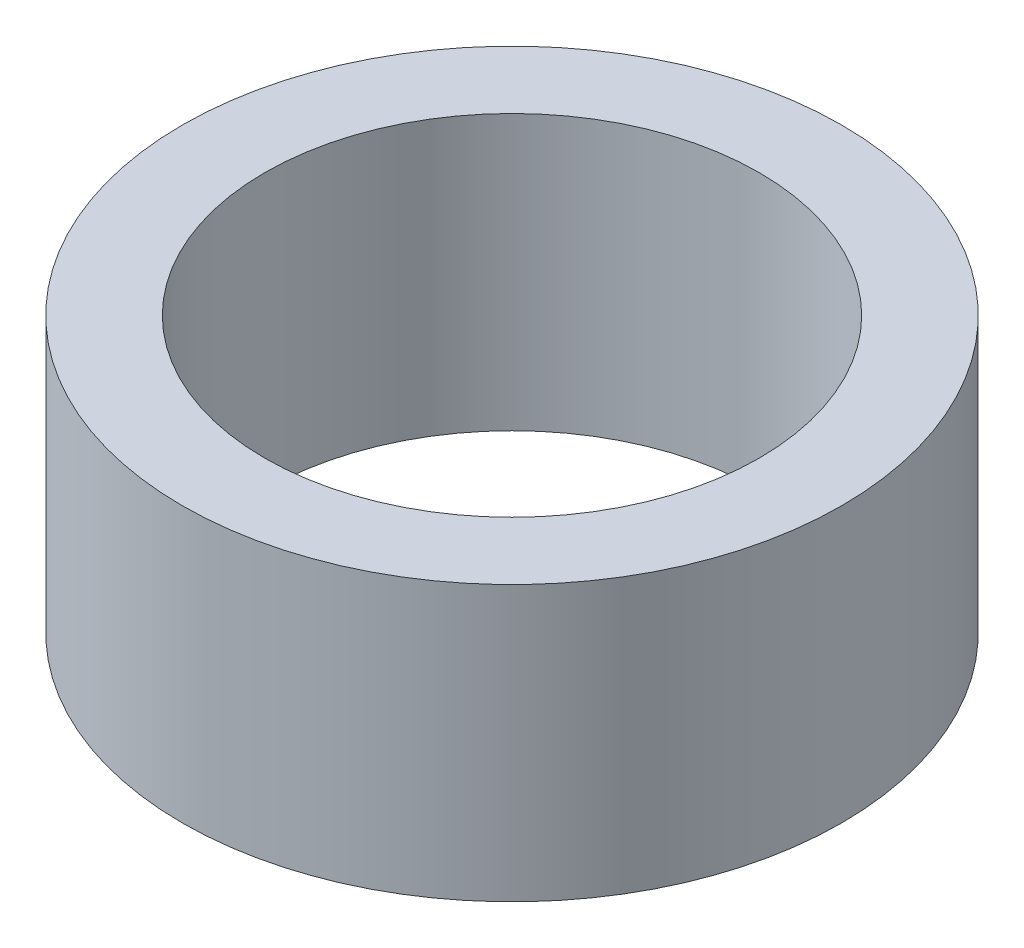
ISO-10303-21;
HEADER;
FILE_DESCRIPTION(('STEP AP214'),'2;1');
FILE_NAME('part.step','',(''),(''),'','','');
FILE_SCHEMA(('AUTOMOTIVE_DESIGN { 1 0 10303 214 1 1 1 1 }'));
ENDSEC;
DATA;
#1=APPLICATION_CONTEXT('core data for automotive mechanical design processes');
#2=APPLICATION_PROTOCOL_DEFINITION('international standard','automotive_design',2000,#1);
#3=PRODUCT_CONTEXT('',#1,'mechanical');
#4=PRODUCT('Part','Part','',(#3));
#5=PRODUCT_RELATED_PRODUCT_CATEGORY('part','',(#4));
#6=PRODUCT_DEFINITION_FORMATION('','',#4);
#7=PRODUCT_DEFINITION_CONTEXT('part definition',#1,'design');
#8=PRODUCT_DEFINITION('design','',#6,#7);
#9=PRODUCT_DEFINITION_SHAPE('','',#8);
#10=(LENGTH_UNIT() NAMED_UNIT(*) SI_UNIT(.MILLI.,.METRE.));
#11=(NAMED_UNIT(*) PLANE_ANGLE_UNIT() SI_UNIT($,.RADIAN.));
#12=(NAMED_UNIT(*) SI_UNIT($,.STERADIAN.) SOLID_ANGLE_UNIT());
#13=UNCERTAINTY_MEASURE_WITH_UNIT(LENGTH_MEASURE(1.E-05),#10,'distance_accuracy_value','');
#14=(GEOMETRIC_REPRESENTATION_CONTEXT(3) GLOBAL_UNCERTAINTY_ASSIGNED_CONTEXT((#13)) GLOBAL_UNIT_ASSIGNED_CONTEXT((#10,
#11,#12)) REPRESENTATION_CONTEXT('',''));
#15=CARTESIAN_POINT('',(0.,0.,0.));
#16=DIRECTION('',(0.,0.,1.));
#17=DIRECTION('',(1.,0.,0.));
#18=AXIS2_PLACEMENT_3D('',#15,#16,#17);
#19=CARTESIAN_POINT('',(0.,0.,0.));
#20=DIRECTION('',(0.,-1.,0.));
#21=DIRECTION('',(0.,0.,-1.));
#22=AXIS2_PLACEMENT_3D('',#19,#20,#21);
#23=CYLINDRICAL_SURFACE('',#22,4.5);
#24=CARTESIAN_POINT('',(0.,0.,0.));
#25=DIRECTION('',(0.,-1.,0.));
#26=DIRECTION('',(0.,0.,-1.));
#27=AXIS2_PLACEMENT_3D('',#24,#25,#26);
#28=CIRCLE('',#27,4.5);
#29=CARTESIAN_POINT('',(0.,0.,-4.5));
#30=VERTEX_POINT('',#29);
#31=EDGE_CURVE('E48',#30,#30,#28,.T.);
#32=ORIENTED_EDGE('',*,*,#31,.T.);
#33=EDGE_LOOP('',(#32));
#34=FACE_BOUND('',#33,.T.);
#35=CARTESIAN_POINT('',(0.,5.,0.));
#36=DIRECTION('',(0.,-1.,0.));
#37=DIRECTION('',(0.,0.,-1.));
#38=AXIS2_PLACEMENT_3D('',#35,#36,#37);
#39=CIRCLE('',#38,4.5);
#40=CARTESIAN_POINT('',(0.,5.,-4.5));
#41=VERTEX_POINT('',#40);
#42=EDGE_CURVE('E10',#41,#41,#39,.T.);
#43=ORIENTED_EDGE('',*,*,#42,.F.);
#44=EDGE_LOOP('',(#43));
#45=FACE_BOUND('',#44,.T.);
#46=ADVANCED_FACE('F34',(#34,#45),#23,.F.);
#47=CARTESIAN_POINT('',(4.5,5.,0.));
#48=DIRECTION('',(0.,1.,0.));
#49=DIRECTION('',(0.,0.,1.));
#50=AXIS2_PLACEMENT_3D('',#47,#48,#49);
#51=PLANE('',#50);
#52=ORIENTED_EDGE('',*,*,#42,.T.);
#53=EDGE_LOOP('',(#52));
#54=FACE_BOUND('',#53,.T.);
#55=CARTESIAN_POINT('',(0.,5.,0.));
#56=DIRECTION('',(0.,-1.,0.));
#57=DIRECTION('',(0.,0.,-1.));
#58=AXIS2_PLACEMENT_3D('',#55,#56,#57);
#59=CIRCLE('',#58,6.);
#60=CARTESIAN_POINT('',(0.,5.,-6.));
#61=VERTEX_POINT('',#60);
#62=EDGE_CURVE('E40',#61,#61,#59,.T.);
#63=ORIENTED_EDGE('',*,*,#62,.F.);
#64=EDGE_LOOP('',(#63));
#65=FACE_BOUND('',#64,.T.);
#66=ADVANCED_FACE('F64',(#54,#65),#51,.T.);
#67=CARTESIAN_POINT('',(0.,0.,0.));
#68=DIRECTION('',(0.,-1.,0.));
#69=DIRECTION('',(0.,0.,-1.));
#70=AXIS2_PLACEMENT_3D('',#67,#68,#69);
#71=CYLINDRICAL_SURFACE('',#70,6.);
#72=ORIENTED_EDGE('',*,*,#62,.T.);
#73=EDGE_LOOP('',(#72));
#74=FACE_BOUND('',#73,.T.);
#75=CARTESIAN_POINT('',(0.,0.,0.));
#76=DIRECTION('',(0.,-1.,0.));
#77=DIRECTION('',(0.,0.,-1.));
#78=AXIS2_PLACEMENT_3D('',#75,#76,#77);
#79=CIRCLE('',#78,6.);
#80=CARTESIAN_POINT('',(0.,0.,-6.));
#81=VERTEX_POINT('',#80);
#82=EDGE_CURVE('E44',#81,#81,#79,.T.);
#83=ORIENTED_EDGE('',*,*,#82,.F.);
#84=EDGE_LOOP('',(#83));
#85=FACE_BOUND('',#84,.T.);
#86=ADVANCED_FACE('F58',(#74,#85),#71,.T.);
#87=CARTESIAN_POINT('',(4.5,0.,0.));
#88=DIRECTION('',(0.,-1.,0.));
#89=DIRECTION('',(0.,0.,-1.));
#90=AXIS2_PLACEMENT_3D('',#87,#88,#89);
#91=PLANE('',#90);
#92=ORIENTED_EDGE('',*,*,#82,.T.);
#93=EDGE_LOOP('',(#92));
#94=FACE_BOUND('',#93,.T.);
#95=ORIENTED_EDGE('',*,*,#31,.F.);
#96=EDGE_LOOP('',(#95));
#97=FACE_BOUND('',#96,.T.);
#98=ADVANCED_FACE('F56',(#94,#97),#91,.T.);
#99=CLOSED_SHELL('',(#46,#66,#86,#98));
#100=MANIFOLD_SOLID_BREP('B2',#99);
#101=ADVANCED_BREP_SHAPE_REPRESENTATION('',(#18,#100),#14);
#102=SHAPE_DEFINITION_REPRESENTATION(#9,#101);
ENDSEC;
END-ISO-10303-21;
